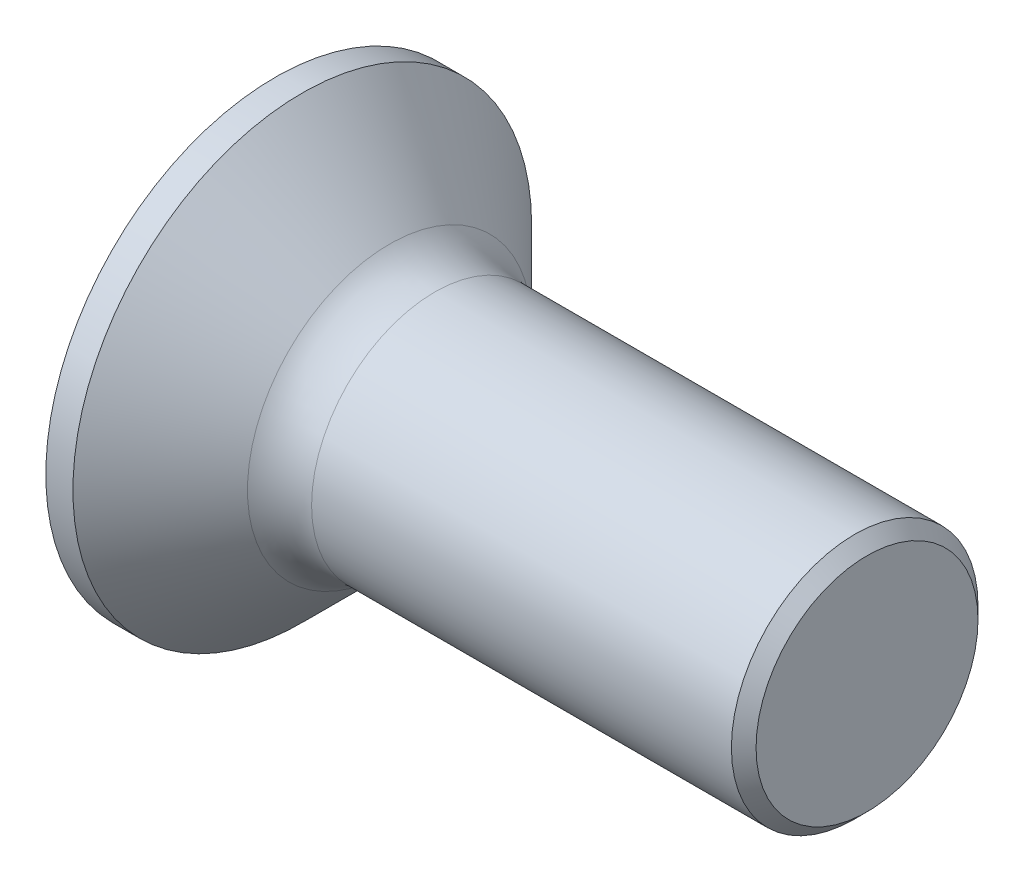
ISO-10303-21;
HEADER;
FILE_DESCRIPTION(('STEP AP214'),'2;1');
FILE_NAME('part.step','',(''),(''),'','','');
FILE_SCHEMA(('AUTOMOTIVE_DESIGN { 1 0 10303 214 1 1 1 1 }'));
ENDSEC;
DATA;
#1=APPLICATION_CONTEXT('core data for automotive mechanical design processes');
#2=APPLICATION_PROTOCOL_DEFINITION('international standard','automotive_design',2000,#1);
#3=PRODUCT_CONTEXT('',#1,'mechanical');
#4=PRODUCT('Part','Part','',(#3));
#5=PRODUCT_RELATED_PRODUCT_CATEGORY('part','',(#4));
#6=PRODUCT_DEFINITION_FORMATION('','',#4);
#7=PRODUCT_DEFINITION_CONTEXT('part definition',#1,'design');
#8=PRODUCT_DEFINITION('design','',#6,#7);
#9=PRODUCT_DEFINITION_SHAPE('','',#8);
#10=(LENGTH_UNIT() NAMED_UNIT(*) SI_UNIT(.MILLI.,.METRE.));
#11=(NAMED_UNIT(*) PLANE_ANGLE_UNIT() SI_UNIT($,.RADIAN.));
#12=(NAMED_UNIT(*) SI_UNIT($,.STERADIAN.) SOLID_ANGLE_UNIT());
#13=UNCERTAINTY_MEASURE_WITH_UNIT(LENGTH_MEASURE(1.E-05),#10,'distance_accuracy_value','');
#14=(GEOMETRIC_REPRESENTATION_CONTEXT(3) GLOBAL_UNCERTAINTY_ASSIGNED_CONTEXT((#13)) GLOBAL_UNIT_ASSIGNED_CONTEXT((#10,
#11,#12)) REPRESENTATION_CONTEXT('',''));
#15=CARTESIAN_POINT('',(0.,0.,0.));
#16=DIRECTION('',(0.,0.,1.));
#17=DIRECTION('',(1.,0.,0.));
#18=AXIS2_PLACEMENT_3D('',#15,#16,#17);
#19=CARTESIAN_POINT('',(0.275,0.,0.));
#20=DIRECTION('',(-1.,0.,0.));
#21=DIRECTION('',(0.,0.,1.));
#22=AXIS2_PLACEMENT_3D('',#19,#20,#21);
#23=CYLINDRICAL_SURFACE('',#22,4.65);
#24=CARTESIAN_POINT('',(0.55,0.,0.));
#25=DIRECTION('',(-1.,0.,0.));
#26=DIRECTION('',(0.,0.,-1.));
#27=AXIS2_PLACEMENT_3D('',#24,#25,#26);
#28=CIRCLE('',#27,4.65);
#29=CARTESIAN_POINT('',(0.55,0.,-4.65));
#30=VERTEX_POINT('',#29);
#31=EDGE_CURVE('E486',#30,#30,#28,.T.);
#32=ORIENTED_EDGE('',*,*,#31,.T.);
#33=EDGE_LOOP('',(#32));
#34=FACE_BOUND('',#33,.T.);
#35=CARTESIAN_POINT('',(0.,0.,0.));
#36=DIRECTION('',(-1.,0.,0.));
#37=DIRECTION('',(0.,0.,-1.));
#38=AXIS2_PLACEMENT_3D('',#35,#36,#37);
#39=CIRCLE('',#38,4.65);
#40=CARTESIAN_POINT('',(0.,0.,-4.65));
#41=VERTEX_POINT('',#40);
#42=EDGE_CURVE('E264',#41,#41,#39,.T.);
#43=ORIENTED_EDGE('',*,*,#42,.F.);
#44=EDGE_LOOP('',(#43));
#45=FACE_BOUND('',#44,.T.);
#46=ADVANCED_FACE('F16',(#34,#45),#23,.T.);
#47=DIRECTION('',(0.707106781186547,0.,0.707106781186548));
#48=VECTOR('',#47,1.);
#49=CARTESIAN_POINT('',(-498994.8,-1.22215714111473E-10,-499000.));
#50=LINE('',#49,#48);
#51=CARTESIAN_POINT('',(5.2,0.,0.));
#52=DIRECTION('',(-1.,0.,0.));
#53=AXIS1_PLACEMENT('',#51,#52);
#54=SURFACE_OF_REVOLUTION('',#50,#53);
#55=CARTESIAN_POINT('',(2.31923881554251,0.,0.));
#56=DIRECTION('',(-1.,0.,0.));
#57=DIRECTION('',(0.,0.,-1.));
#58=AXIS2_PLACEMENT_3D('',#55,#56,#57);
#59=CIRCLE('',#58,2.88076118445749);
#60=CARTESIAN_POINT('',(2.31923881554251,0.,-2.88076118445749));
#61=VERTEX_POINT('',#60);
#62=EDGE_CURVE('E11',#61,#61,#59,.T.);
#63=ORIENTED_EDGE('',*,*,#62,.T.);
#64=EDGE_LOOP('',(#63));
#65=FACE_BOUND('',#64,.T.);
#66=ORIENTED_EDGE('',*,*,#31,.F.);
#67=EDGE_LOOP('',(#66));
#68=FACE_BOUND('',#67,.T.);
#69=ADVANCED_FACE('F350',(#65,#68),#54,.F.);
#70=CARTESIAN_POINT('',(3.23847763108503,0.,0.));
#71=DIRECTION('',(-1.,0.,0.));
#72=DIRECTION('',(0.,0.,1.));
#73=AXIS2_PLACEMENT_3D('',#70,#71,#72);
#74=TOROIDAL_SURFACE('',#73,3.8,1.3);
#75=CARTESIAN_POINT('',(3.23847763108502,0.,0.));
#76=DIRECTION('',(-1.,0.,0.));
#77=DIRECTION('',(0.,0.,-1.));
#78=AXIS2_PLACEMENT_3D('',#75,#76,#77);
#79=CIRCLE('',#78,2.5);
#80=CARTESIAN_POINT('',(3.23847763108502,0.,-2.5));
#81=VERTEX_POINT('',#80);
#82=EDGE_CURVE('E26',#81,#81,#79,.T.);
#83=ORIENTED_EDGE('',*,*,#82,.T.);
#84=EDGE_LOOP('',(#83));
#85=FACE_BOUND('',#84,.T.);
#86=ORIENTED_EDGE('',*,*,#62,.F.);
#87=EDGE_LOOP('',(#86));
#88=FACE_BOUND('',#87,.T.);
#89=ADVANCED_FACE('F354',(#85,#88),#74,.F.);
#90=CARTESIAN_POINT('',(7.49423881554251,0.,0.));
#91=DIRECTION('',(-1.,0.,0.));
#92=DIRECTION('',(0.,0.,1.));
#93=AXIS2_PLACEMENT_3D('',#90,#91,#92);
#94=CYLINDRICAL_SURFACE('',#93,2.5);
#95=CARTESIAN_POINT('',(11.75,0.,0.));
#96=DIRECTION('',(-1.,0.,0.));
#97=DIRECTION('',(0.,0.,-1.));
#98=AXIS2_PLACEMENT_3D('',#95,#96,#97);
#99=CIRCLE('',#98,2.5);
#100=CARTESIAN_POINT('',(11.75,0.,-2.5));
#101=VERTEX_POINT('',#100);
#102=EDGE_CURVE('E512',#101,#101,#99,.T.);
#103=ORIENTED_EDGE('',*,*,#102,.T.);
#104=EDGE_LOOP('',(#103));
#105=FACE_BOUND('',#104,.T.);
#106=ORIENTED_EDGE('',*,*,#82,.F.);
#107=EDGE_LOOP('',(#106));
#108=FACE_BOUND('',#107,.T.);
#109=ADVANCED_FACE('F358',(#105,#108),#94,.T.);
#110=DIRECTION('',(0.707106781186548,0.,0.707106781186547));
#111=VECTOR('',#110,1.);
#112=CARTESIAN_POINT('',(-498985.75,-1.22215714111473E-10,-499000.));
#113=LINE('',#112,#111);
#114=CARTESIAN_POINT('',(14.25,0.,0.));
#115=DIRECTION('',(-1.,0.,0.));
#116=AXIS1_PLACEMENT('',#114,#115);
#117=SURFACE_OF_REVOLUTION('',#113,#116);
#118=CARTESIAN_POINT('',(12.,0.,0.));
#119=DIRECTION('',(-1.,0.,0.));
#120=DIRECTION('',(0.,0.,-1.));
#121=AXIS2_PLACEMENT_3D('',#118,#119,#120);
#122=CIRCLE('',#121,2.25);
#123=CARTESIAN_POINT('',(12.,0.,-2.25));
#124=VERTEX_POINT('',#123);
#125=EDGE_CURVE('E509',#124,#124,#122,.T.);
#126=ORIENTED_EDGE('',*,*,#125,.T.);
#127=EDGE_LOOP('',(#126));
#128=FACE_BOUND('',#127,.T.);
#129=ORIENTED_EDGE('',*,*,#102,.F.);
#130=EDGE_LOOP('',(#129));
#131=FACE_BOUND('',#130,.T.);
#132=ADVANCED_FACE('F362',(#128,#131),#117,.F.);
#133=CARTESIAN_POINT('',(12.,0.,-1.125));
#134=DIRECTION('',(1.,0.,0.));
#135=DIRECTION('',(0.,1.,0.));
#136=AXIS2_PLACEMENT_3D('',#133,#134,#135);
#137=PLANE('',#136);
#138=ORIENTED_EDGE('',*,*,#125,.F.);
#139=EDGE_LOOP('',(#138));
#140=FACE_BOUND('',#139,.T.);
#141=ADVANCED_FACE('F366',(#140),#137,.T.);
#142=CARTESIAN_POINT('',(-1.,-2.7,0.675));
#143=DIRECTION('',(0.,1.,0.));
#144=DIRECTION('',(0.,0.,1.));
#145=AXIS2_PLACEMENT_3D('',#142,#143,#144);
#146=PLANE('',#145);
#147=DIRECTION('',(0.,0.,-1.));
#148=VECTOR('',#147,1.);
#149=CARTESIAN_POINT('',(0.,-2.7,-0.825));
#150=LINE('',#149,#148);
#151=CARTESIAN_POINT('',(0.,-2.7,0.675));
#152=VERTEX_POINT('',#151);
#153=CARTESIAN_POINT('',(0.,-2.7,-0.675));
#154=VERTEX_POINT('',#153);
#155=EDGE_CURVE('E35',#152,#154,#150,.T.);
#156=ORIENTED_EDGE('',*,*,#155,.F.);
#157=DIRECTION('',(1.,0.,0.));
#158=VECTOR('',#157,1.);
#159=CARTESIAN_POINT('',(-1.,-2.7,0.675));
#160=LINE('',#159,#158);
#161=CARTESIAN_POINT('',(1.35,-2.7,0.675));
#162=VERTEX_POINT('',#161);
#163=EDGE_CURVE('E249',#152,#162,#160,.T.);
#164=ORIENTED_EDGE('',*,*,#163,.T.);
#165=DIRECTION('',(0.,0.,-1.));
#166=VECTOR('',#165,1.);
#167=CARTESIAN_POINT('',(1.35,-2.7,0.675));
#168=LINE('',#167,#166);
#169=CARTESIAN_POINT('',(1.35,-2.7,-0.675));
#170=VERTEX_POINT('',#169);
#171=EDGE_CURVE('E245',#162,#170,#168,.T.);
#172=ORIENTED_EDGE('',*,*,#171,.T.);
#173=DIRECTION('',(1.,0.,0.));
#174=VECTOR('',#173,1.);
#175=CARTESIAN_POINT('',(-1.,-2.7,-0.675));
#176=LINE('',#175,#174);
#177=EDGE_CURVE('E557',#154,#170,#176,.T.);
#178=ORIENTED_EDGE('',*,*,#177,.F.);
#179=EDGE_LOOP('',(#156,#164,#172,#178));
#180=FACE_BOUND('',#179,.T.);
#181=ADVANCED_FACE('F370',(#180),#146,.T.);
#182=CARTESIAN_POINT('',(4.05,0.675,0.675));
#183=DIRECTION('',(-0.6,-0.8,0.));
#184=DIRECTION('',(0.8,-0.6,0.));
#185=AXIS2_PLACEMENT_3D('',#182,#183,#184);
#186=PLANE('',#185);
#187=DIRECTION('',(-0.8,0.6,0.));
#188=VECTOR('',#187,1.);
#189=CARTESIAN_POINT('',(4.05,0.675,-0.675));
#190=LINE('',#189,#188);
#191=CARTESIAN_POINT('',(4.05,0.675,-0.675));
#192=VERTEX_POINT('',#191);
#193=CARTESIAN_POINT('',(1.35,2.7,-0.675));
#194=VERTEX_POINT('',#193);
#195=EDGE_CURVE('E228',#192,#194,#190,.T.);
#196=ORIENTED_EDGE('',*,*,#195,.F.);
#197=DIRECTION('',(0.,0.,-1.));
#198=VECTOR('',#197,1.);
#199=CARTESIAN_POINT('',(4.05,0.675,0.675));
#200=LINE('',#199,#198);
#201=CARTESIAN_POINT('',(4.05,0.675,0.675));
#202=VERTEX_POINT('',#201);
#203=EDGE_CURVE('E220',#202,#192,#200,.T.);
#204=ORIENTED_EDGE('',*,*,#203,.F.);
#205=DIRECTION('',(-0.8,0.6,0.));
#206=VECTOR('',#205,1.);
#207=CARTESIAN_POINT('',(4.05,0.675,0.675));
#208=LINE('',#207,#206);
#209=CARTESIAN_POINT('',(1.35,2.7,0.675));
#210=VERTEX_POINT('',#209);
#211=EDGE_CURVE('E225',#202,#210,#208,.T.);
#212=ORIENTED_EDGE('',*,*,#211,.T.);
#213=DIRECTION('',(0.,0.,-1.));
#214=VECTOR('',#213,1.);
#215=CARTESIAN_POINT('',(1.35,2.7,0.675));
#216=LINE('',#215,#214);
#217=EDGE_CURVE('E246',#210,#194,#216,.T.);
#218=ORIENTED_EDGE('',*,*,#217,.T.);
#219=EDGE_LOOP('',(#196,#204,#212,#218));
#220=FACE_BOUND('',#219,.T.);
#221=ADVANCED_FACE('F222',(#220),#186,.T.);
#222=CARTESIAN_POINT('',(4.05,-0.675,0.675));
#223=DIRECTION('',(-1.,0.,0.));
#224=DIRECTION('',(0.,0.,1.));
#225=AXIS2_PLACEMENT_3D('',#222,#223,#224);
#226=PLANE('',#225);
#227=DIRECTION('',(0.,0.,-1.));
#228=VECTOR('',#227,1.);
#229=CARTESIAN_POINT('',(4.05,-0.666666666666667,0.3375));
#230=LINE('',#229,#228);
#231=CARTESIAN_POINT('',(4.05,-0.666666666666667,0.675));
#232=VERTEX_POINT('',#231);
#233=CARTESIAN_POINT('',(4.05,-0.666666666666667,-0.675));
#234=VERTEX_POINT('',#233);
#235=EDGE_CURVE('E251',#232,#234,#230,.T.);
#236=ORIENTED_EDGE('',*,*,#235,.T.);
#237=DIRECTION('',(0.,1.,0.));
#238=VECTOR('',#237,1.);
#239=CARTESIAN_POINT('',(4.05,-0.675,-0.675));
#240=LINE('',#239,#238);
#241=CARTESIAN_POINT('',(4.05,-0.675,-0.675));
#242=VERTEX_POINT('',#241);
#243=EDGE_CURVE('E274',#242,#234,#240,.T.);
#244=ORIENTED_EDGE('',*,*,#243,.F.);
#245=DIRECTION('',(0.,0.,-1.));
#246=VECTOR('',#245,1.);
#247=CARTESIAN_POINT('',(4.05,-0.675,0.675));
#248=LINE('',#247,#246);
#249=CARTESIAN_POINT('',(4.05,-0.675,0.675));
#250=VERTEX_POINT('',#249);
#251=EDGE_CURVE('E331',#250,#242,#248,.T.);
#252=ORIENTED_EDGE('',*,*,#251,.F.);
#253=DIRECTION('',(0.,1.,0.));
#254=VECTOR('',#253,1.);
#255=CARTESIAN_POINT('',(4.05,-0.675,0.675));
#256=LINE('',#255,#254);
#257=EDGE_CURVE('E547',#250,#232,#256,.T.);
#258=ORIENTED_EDGE('',*,*,#257,.T.);
#259=EDGE_LOOP('',(#236,#244,#252,#258));
#260=FACE_BOUND('',#259,.T.);
#261=ADVANCED_FACE('F376',(#260),#226,.T.);
#262=CARTESIAN_POINT('',(1.35,-2.7,0.675));
#263=DIRECTION('',(-0.6,0.8,0.));
#264=DIRECTION('',(-0.8,-0.6,0.));
#265=AXIS2_PLACEMENT_3D('',#262,#263,#264);
#266=PLANE('',#265);
#267=DIRECTION('',(0.8,0.6,0.));
#268=VECTOR('',#267,1.);
#269=CARTESIAN_POINT('',(1.35,-2.7,-0.675));
#270=LINE('',#269,#268);
#271=EDGE_CURVE('E514',#170,#242,#270,.T.);
#272=ORIENTED_EDGE('',*,*,#271,.F.);
#273=ORIENTED_EDGE('',*,*,#171,.F.);
#274=DIRECTION('',(0.8,0.6,0.));
#275=VECTOR('',#274,1.);
#276=CARTESIAN_POINT('',(1.35,-2.7,0.675));
#277=LINE('',#276,#275);
#278=EDGE_CURVE('E550',#162,#250,#277,.T.);
#279=ORIENTED_EDGE('',*,*,#278,.T.);
#280=ORIENTED_EDGE('',*,*,#251,.T.);
#281=EDGE_LOOP('',(#272,#273,#279,#280));
#282=FACE_BOUND('',#281,.T.);
#283=ADVANCED_FACE('F379',(#282),#266,.T.);
#284=CARTESIAN_POINT('',(1.35,2.7,0.675));
#285=DIRECTION('',(0.,-1.,0.));
#286=DIRECTION('',(0.,0.,-1.));
#287=AXIS2_PLACEMENT_3D('',#284,#285,#286);
#288=PLANE('',#287);
#289=DIRECTION('',(0.,0.,1.));
#290=VECTOR('',#289,1.);
#291=CARTESIAN_POINT('',(0.,2.7,-0.825));
#292=LINE('',#291,#290);
#293=CARTESIAN_POINT('',(0.,2.7,-0.675));
#294=VERTEX_POINT('',#293);
#295=CARTESIAN_POINT('',(0.,2.7,0.675));
#296=VERTEX_POINT('',#295);
#297=EDGE_CURVE('E496',#294,#296,#292,.T.);
#298=ORIENTED_EDGE('',*,*,#297,.F.);
#299=DIRECTION('',(-1.,0.,0.));
#300=VECTOR('',#299,1.);
#301=CARTESIAN_POINT('',(1.35,2.7,-0.675));
#302=LINE('',#301,#300);
#303=EDGE_CURVE('E308',#194,#294,#302,.T.);
#304=ORIENTED_EDGE('',*,*,#303,.F.);
#305=ORIENTED_EDGE('',*,*,#217,.F.);
#306=DIRECTION('',(-1.,0.,0.));
#307=VECTOR('',#306,1.);
#308=CARTESIAN_POINT('',(1.35,2.7,0.675));
#309=LINE('',#308,#307);
#310=EDGE_CURVE('E244',#210,#296,#309,.T.);
#311=ORIENTED_EDGE('',*,*,#310,.T.);
#312=EDGE_LOOP('',(#298,#304,#305,#311));
#313=FACE_BOUND('',#312,.T.);
#314=ADVANCED_FACE('F383',(#313),#288,.T.);
#315=CARTESIAN_POINT('',(0.,0.,0.675));
#316=DIRECTION('',(0.,0.,-1.));
#317=DIRECTION('',(-1.,0.,0.));
#318=AXIS2_PLACEMENT_3D('',#315,#316,#317);
#319=PLANE('',#318);
#320=DIRECTION('',(-1.,0.,0.));
#321=VECTOR('',#320,1.);
#322=CARTESIAN_POINT('',(0.,0.873581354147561,0.675));
#323=LINE('',#322,#321);
#324=CARTESIAN_POINT('',(1.,0.873581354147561,0.675));
#325=VERTEX_POINT('',#324);
#326=CARTESIAN_POINT('',(0.,0.873581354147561,0.675));
#327=VERTEX_POINT('',#326);
#328=EDGE_CURVE('E332',#325,#327,#323,.T.);
#329=ORIENTED_EDGE('',*,*,#328,.T.);
#330=DIRECTION('',(0.,-1.,0.));
#331=VECTOR('',#330,1.);
#332=CARTESIAN_POINT('',(0.,0.,0.675));
#333=LINE('',#332,#331);
#334=EDGE_CURVE('E499',#296,#327,#333,.T.);
#335=ORIENTED_EDGE('',*,*,#334,.F.);
#336=ORIENTED_EDGE('',*,*,#310,.F.);
#337=ORIENTED_EDGE('',*,*,#211,.F.);
#338=DIRECTION('',(0.,1.,0.));
#339=VECTOR('',#338,1.);
#340=CARTESIAN_POINT('',(4.05,-0.675,0.675));
#341=LINE('',#340,#339);
#342=CARTESIAN_POINT('',(4.05,0.666666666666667,0.675));
#343=VERTEX_POINT('',#342);
#344=EDGE_CURVE('E230',#343,#202,#341,.T.);
#345=ORIENTED_EDGE('',*,*,#344,.F.);
#346=DIRECTION('',(-1.,0.,0.));
#347=VECTOR('',#346,1.);
#348=CARTESIAN_POINT('',(0.,0.666666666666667,0.675));
#349=LINE('',#348,#347);
#350=CARTESIAN_POINT('',(1.,0.666666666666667,0.675));
#351=VERTEX_POINT('',#350);
#352=EDGE_CURVE('E534',#343,#351,#349,.T.);
#353=ORIENTED_EDGE('',*,*,#352,.T.);
#354=DIRECTION('',(0.,1.,0.));
#355=VECTOR('',#354,1.);
#356=CARTESIAN_POINT('',(1.,0.,0.675));
#357=LINE('',#356,#355);
#358=EDGE_CURVE('E282',#351,#325,#357,.T.);
#359=ORIENTED_EDGE('',*,*,#358,.T.);
#360=EDGE_LOOP('',(#329,#335,#336,#337,#345,#353,#359));
#361=FACE_BOUND('',#360,.T.);
#362=ADVANCED_FACE('F242',(#361),#319,.T.);
#363=CARTESIAN_POINT('',(4.05,-0.675,0.675));
#364=DIRECTION('',(-1.,0.,0.));
#365=DIRECTION('',(0.,0.,1.));
#366=AXIS2_PLACEMENT_3D('',#363,#364,#365);
#367=PLANE('',#366);
#368=DIRECTION('',(0.,0.,1.));
#369=VECTOR('',#368,1.);
#370=CARTESIAN_POINT('',(4.05,0.666666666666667,0.3375));
#371=LINE('',#370,#369);
#372=CARTESIAN_POINT('',(4.05,0.666666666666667,-0.675));
#373=VERTEX_POINT('',#372);
#374=EDGE_CURVE('E236',#373,#343,#371,.T.);
#375=ORIENTED_EDGE('',*,*,#374,.T.);
#376=ORIENTED_EDGE('',*,*,#344,.T.);
#377=ORIENTED_EDGE('',*,*,#203,.T.);
#378=DIRECTION('',(0.,1.,0.));
#379=VECTOR('',#378,1.);
#380=CARTESIAN_POINT('',(4.05,-0.675,-0.675));
#381=LINE('',#380,#379);
#382=EDGE_CURVE('E313',#373,#192,#381,.T.);
#383=ORIENTED_EDGE('',*,*,#382,.F.);
#384=EDGE_LOOP('',(#375,#376,#377,#383));
#385=FACE_BOUND('',#384,.T.);
#386=ADVANCED_FACE('F234',(#385),#367,.T.);
#387=CARTESIAN_POINT('',(0.,0.,-0.675));
#388=DIRECTION('',(0.,0.,1.));
#389=DIRECTION('',(1.,0.,0.));
#390=AXIS2_PLACEMENT_3D('',#387,#388,#389);
#391=PLANE('',#390);
#392=DIRECTION('',(-1.,0.,0.));
#393=VECTOR('',#392,1.);
#394=CARTESIAN_POINT('',(0.,-0.873581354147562,-0.675));
#395=LINE('',#394,#393);
#396=CARTESIAN_POINT('',(1.,-0.873581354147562,-0.675));
#397=VERTEX_POINT('',#396);
#398=CARTESIAN_POINT('',(0.,-0.873581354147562,-0.675));
#399=VERTEX_POINT('',#398);
#400=EDGE_CURVE('E231',#397,#399,#395,.T.);
#401=ORIENTED_EDGE('',*,*,#400,.T.);
#402=DIRECTION('',(0.,1.,0.));
#403=VECTOR('',#402,1.);
#404=CARTESIAN_POINT('',(0.,0.,-0.675));
#405=LINE('',#404,#403);
#406=EDGE_CURVE('E495',#154,#399,#405,.T.);
#407=ORIENTED_EDGE('',*,*,#406,.F.);
#408=ORIENTED_EDGE('',*,*,#177,.T.);
#409=ORIENTED_EDGE('',*,*,#271,.T.);
#410=ORIENTED_EDGE('',*,*,#243,.T.);
#411=DIRECTION('',(-1.,0.,0.));
#412=VECTOR('',#411,1.);
#413=CARTESIAN_POINT('',(0.,-0.666666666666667,-0.675));
#414=LINE('',#413,#412);
#415=CARTESIAN_POINT('',(1.,-0.666666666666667,-0.675));
#416=VERTEX_POINT('',#415);
#417=EDGE_CURVE('E271',#234,#416,#414,.T.);
#418=ORIENTED_EDGE('',*,*,#417,.T.);
#419=DIRECTION('',(0.,-1.,0.));
#420=VECTOR('',#419,1.);
#421=CARTESIAN_POINT('',(1.,0.,-0.675));
#422=LINE('',#421,#420);
#423=EDGE_CURVE('E275',#416,#397,#422,.T.);
#424=ORIENTED_EDGE('',*,*,#423,.T.);
#425=EDGE_LOOP('',(#401,#407,#408,#409,#410,#418,#424));
#426=FACE_BOUND('',#425,.T.);
#427=ADVANCED_FACE('F392',(#426),#391,.T.);
#428=CARTESIAN_POINT('',(0.,0.,-2.325));
#429=DIRECTION('',(-1.,0.,0.));
#430=DIRECTION('',(0.,0.,1.));
#431=AXIS2_PLACEMENT_3D('',#428,#429,#430);
#432=PLANE('',#431);
#433=ORIENTED_EDGE('',*,*,#42,.T.);
#434=EDGE_LOOP('',(#433));
#435=FACE_BOUND('',#434,.T.);
#436=DIRECTION('',(0.,-0.642787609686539,0.766044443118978));
#437=VECTOR('',#436,1.);
#438=CARTESIAN_POINT('',(0.,0.816147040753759,-0.606552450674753));
#439=LINE('',#438,#437);
#440=CARTESIAN_POINT('',(0.,1.90918830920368,-1.90918830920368));
#441=VERTEX_POINT('',#440);
#442=CARTESIAN_POINT('',(0.,0.873581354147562,-0.675));
#443=VERTEX_POINT('',#442);
#444=EDGE_CURVE('E261',#441,#443,#439,.T.);
#445=ORIENTED_EDGE('',*,*,#444,.T.);
#446=DIRECTION('',(0.,1.,0.));
#447=VECTOR('',#446,1.);
#448=CARTESIAN_POINT('',(0.,0.,-0.675));
#449=LINE('',#448,#447);
#450=EDGE_CURVE('E265',#443,#294,#449,.T.);
#451=ORIENTED_EDGE('',*,*,#450,.T.);
#452=ORIENTED_EDGE('',*,*,#297,.T.);
#453=ORIENTED_EDGE('',*,*,#334,.T.);
#454=DIRECTION('',(0.,0.642787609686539,0.766044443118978));
#455=VECTOR('',#454,1.);
#456=CARTESIAN_POINT('',(0.,0.472307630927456,0.196780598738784));
#457=LINE('',#456,#455);
#458=CARTESIAN_POINT('',(0.,1.90918830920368,1.90918830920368));
#459=VERTEX_POINT('',#458);
#460=EDGE_CURVE('E526',#327,#459,#457,.T.);
#461=ORIENTED_EDGE('',*,*,#460,.T.);
#462=DIRECTION('',(0.,-0.766044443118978,-0.642787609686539));
#463=VECTOR('',#462,1.);
#464=CARTESIAN_POINT('',(0.,-0.648050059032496,-0.236589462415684));
#465=LINE('',#464,#463);
#466=CARTESIAN_POINT('',(0.,0.666666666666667,0.866588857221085));
#467=VERTEX_POINT('',#466);
#468=EDGE_CURVE('E530',#459,#467,#465,.T.);
#469=ORIENTED_EDGE('',*,*,#468,.T.);
#470=DIRECTION('',(0.,0.,1.));
#471=VECTOR('',#470,1.);
#472=CARTESIAN_POINT('',(0.,0.666666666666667,-1.1625));
#473=LINE('',#472,#471);
#474=CARTESIAN_POINT('',(0.,0.666666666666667,2.7));
#475=VERTEX_POINT('',#474);
#476=EDGE_CURVE('E503',#467,#475,#473,.T.);
#477=ORIENTED_EDGE('',*,*,#476,.T.);
#478=DIRECTION('',(0.,-1.,0.));
#479=VECTOR('',#478,1.);
#480=CARTESIAN_POINT('',(0.,0.333333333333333,2.7));
#481=LINE('',#480,#479);
#482=CARTESIAN_POINT('',(0.,-0.666666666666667,2.7));
#483=VERTEX_POINT('',#482);
#484=EDGE_CURVE('E500',#475,#483,#481,.T.);
#485=ORIENTED_EDGE('',*,*,#484,.T.);
#486=DIRECTION('',(0.,0.,-1.));
#487=VECTOR('',#486,1.);
#488=CARTESIAN_POINT('',(0.,-0.666666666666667,-1.1625));
#489=LINE('',#488,#487);
#490=CARTESIAN_POINT('',(0.,-0.666666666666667,0.866588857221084));
#491=VERTEX_POINT('',#490);
#492=EDGE_CURVE('E504',#483,#491,#489,.T.);
#493=ORIENTED_EDGE('',*,*,#492,.T.);
#494=DIRECTION('',(0.,-0.766044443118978,0.642787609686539));
#495=VECTOR('',#494,1.);
#496=CARTESIAN_POINT('',(0.,-0.306544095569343,0.564410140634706));
#497=LINE('',#496,#495);
#498=CARTESIAN_POINT('',(0.,-1.90918830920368,1.90918830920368));
#499=VERTEX_POINT('',#498);
#500=EDGE_CURVE('E590',#491,#499,#497,.T.);
#501=ORIENTED_EDGE('',*,*,#500,.T.);
#502=DIRECTION('',(0.,0.642787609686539,-0.766044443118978));
#503=VECTOR('',#502,1.);
#504=CARTESIAN_POINT('',(0.,0.328691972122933,-0.757813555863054));
#505=LINE('',#504,#503);
#506=CARTESIAN_POINT('',(0.,-0.873581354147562,0.675));
#507=VERTEX_POINT('',#506);
#508=EDGE_CURVE('E585',#499,#507,#505,.T.);
#509=ORIENTED_EDGE('',*,*,#508,.T.);
#510=DIRECTION('',(0.,-1.,0.));
#511=VECTOR('',#510,1.);
#512=CARTESIAN_POINT('',(0.,0.,0.675));
#513=LINE('',#512,#511);
#514=EDGE_CURVE('E494',#507,#152,#513,.T.);
#515=ORIENTED_EDGE('',*,*,#514,.T.);
#516=ORIENTED_EDGE('',*,*,#155,.T.);
#517=ORIENTED_EDGE('',*,*,#406,.T.);
#518=DIRECTION('',(0.,-0.642787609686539,-0.766044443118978));
#519=VECTOR('',#518,1.);
#520=CARTESIAN_POINT('',(0.,-1.61714664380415,-1.56114660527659));
#521=LINE('',#520,#519);
#522=CARTESIAN_POINT('',(0.,-1.90918830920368,-1.90918830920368));
#523=VERTEX_POINT('',#522);
#524=EDGE_CURVE('E506',#399,#523,#521,.T.);
#525=ORIENTED_EDGE('',*,*,#524,.T.);
#526=DIRECTION('',(0.,0.766044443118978,0.642787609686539));
#527=VECTOR('',#526,1.);
#528=CARTESIAN_POINT('',(0.,-0.496788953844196,-0.724044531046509));
#529=LINE('',#528,#527);
#530=CARTESIAN_POINT('',(0.,-0.666666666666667,-0.866588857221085));
#531=VERTEX_POINT('',#530);
#532=EDGE_CURVE('E269',#523,#531,#529,.T.);
#533=ORIENTED_EDGE('',*,*,#532,.T.);
#534=DIRECTION('',(0.,0.,-1.));
#535=VECTOR('',#534,1.);
#536=CARTESIAN_POINT('',(0.,-0.666666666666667,-1.1625));
#537=LINE('',#536,#535);
#538=CARTESIAN_POINT('',(0.,-0.666666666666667,-2.7));
#539=VERTEX_POINT('',#538);
#540=EDGE_CURVE('E266',#531,#539,#537,.T.);
#541=ORIENTED_EDGE('',*,*,#540,.T.);
#542=DIRECTION('',(0.,1.,0.));
#543=VECTOR('',#542,1.);
#544=CARTESIAN_POINT('',(0.,0.333333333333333,-2.7));
#545=LINE('',#544,#543);
#546=CARTESIAN_POINT('',(0.,0.666666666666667,-2.7));
#547=VERTEX_POINT('',#546);
#548=EDGE_CURVE('E270',#539,#547,#545,.T.);
#549=ORIENTED_EDGE('',*,*,#548,.T.);
#550=DIRECTION('',(0.,0.,1.));
#551=VECTOR('',#550,1.);
#552=CARTESIAN_POINT('',(0.,0.666666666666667,-1.1625));
#553=LINE('',#552,#551);
#554=CARTESIAN_POINT('',(0.,0.666666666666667,-0.866588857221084));
#555=VERTEX_POINT('',#554);
#556=EDGE_CURVE('E529',#547,#555,#553,.T.);
#557=ORIENTED_EDGE('',*,*,#556,.T.);
#558=DIRECTION('',(0.,0.766044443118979,-0.642787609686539));
#559=VECTOR('',#558,1.);
#560=CARTESIAN_POINT('',(0.,1.45138310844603,-1.5250441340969));
#561=LINE('',#560,#559);
#562=EDGE_CURVE('E562',#555,#441,#561,.T.);
#563=ORIENTED_EDGE('',*,*,#562,.T.);
#564=EDGE_LOOP('',(#445,#451,#452,#453,#461,#469,#477,#485,#493,#501,#509,#515,#516,#517,#525,
#533,#541,#549,#557,#563));
#565=FACE_BOUND('',#564,.T.);
#566=ADVANCED_FACE('F395',(#435,#565),#432,.T.);
#567=CARTESIAN_POINT('',(0.,-0.666666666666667,0.));
#568=DIRECTION('',(0.,1.,0.));
#569=DIRECTION('',(0.,0.,1.));
#570=AXIS2_PLACEMENT_3D('',#567,#568,#569);
#571=PLANE('',#570);
#572=DIRECTION('',(0.,0.,1.));
#573=VECTOR('',#572,1.);
#574=CARTESIAN_POINT('',(1.,-0.666666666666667,0.));
#575=LINE('',#574,#573);
#576=CARTESIAN_POINT('',(1.,-0.666666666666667,-0.866588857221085));
#577=VERTEX_POINT('',#576);
#578=EDGE_CURVE('E520',#577,#416,#575,.T.);
#579=ORIENTED_EDGE('',*,*,#578,.T.);
#580=ORIENTED_EDGE('',*,*,#417,.F.);
#581=ORIENTED_EDGE('',*,*,#235,.F.);
#582=DIRECTION('',(1.,0.,0.));
#583=VECTOR('',#582,1.);
#584=CARTESIAN_POINT('',(0.,-0.666666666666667,0.675));
#585=LINE('',#584,#583);
#586=CARTESIAN_POINT('',(1.,-0.666666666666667,0.675));
#587=VERTEX_POINT('',#586);
#588=EDGE_CURVE('E346',#587,#232,#585,.T.);
#589=ORIENTED_EDGE('',*,*,#588,.F.);
#590=DIRECTION('',(0.,0.,1.));
#591=VECTOR('',#590,1.);
#592=CARTESIAN_POINT('',(1.,-0.666666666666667,0.));
#593=LINE('',#592,#591);
#594=CARTESIAN_POINT('',(1.,-0.666666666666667,0.866588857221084));
#595=VERTEX_POINT('',#594);
#596=EDGE_CURVE('E291',#587,#595,#593,.T.);
#597=ORIENTED_EDGE('',*,*,#596,.T.);
#598=DIRECTION('',(-1.,0.,0.));
#599=VECTOR('',#598,1.);
#600=CARTESIAN_POINT('',(0.,-0.666666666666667,0.866588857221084));
#601=LINE('',#600,#599);
#602=EDGE_CURVE('E288',#595,#491,#601,.T.);
#603=ORIENTED_EDGE('',*,*,#602,.T.);
#604=ORIENTED_EDGE('',*,*,#492,.F.);
#605=DIRECTION('',(1.,0.,0.));
#606=VECTOR('',#605,1.);
#607=CARTESIAN_POINT('',(-1.,-0.666666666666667,2.7));
#608=LINE('',#607,#606);
#609=CARTESIAN_POINT('',(1.35,-0.666666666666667,2.7));
#610=VERTEX_POINT('',#609);
#611=EDGE_CURVE('E292',#483,#610,#608,.T.);
#612=ORIENTED_EDGE('',*,*,#611,.T.);
#613=DIRECTION('',(0.802852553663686,0.,-0.596177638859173));
#614=VECTOR('',#613,1.);
#615=CARTESIAN_POINT('',(1.35,-0.666666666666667,2.7));
#616=LINE('',#615,#614);
#617=CARTESIAN_POINT('',(4.077,-0.666666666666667,0.675));
#618=VERTEX_POINT('',#617);
#619=EDGE_CURVE('E307',#610,#618,#616,.T.);
#620=ORIENTED_EDGE('',*,*,#619,.T.);
#621=DIRECTION('',(0.,0.,-1.));
#622=VECTOR('',#621,1.);
#623=CARTESIAN_POINT('',(4.077,-0.666666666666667,0.675));
#624=LINE('',#623,#622);
#625=CARTESIAN_POINT('',(4.077,-0.666666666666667,-0.675));
#626=VERTEX_POINT('',#625);
#627=EDGE_CURVE('E322',#618,#626,#624,.T.);
#628=ORIENTED_EDGE('',*,*,#627,.T.);
#629=DIRECTION('',(-0.802852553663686,0.,-0.596177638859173));
#630=VECTOR('',#629,1.);
#631=CARTESIAN_POINT('',(4.077,-0.666666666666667,-0.675));
#632=LINE('',#631,#630);
#633=CARTESIAN_POINT('',(1.35,-0.666666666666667,-2.7));
#634=VERTEX_POINT('',#633);
#635=EDGE_CURVE('E319',#626,#634,#632,.T.);
#636=ORIENTED_EDGE('',*,*,#635,.T.);
#637=DIRECTION('',(-1.,0.,0.));
#638=VECTOR('',#637,1.);
#639=CARTESIAN_POINT('',(1.35,-0.666666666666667,-2.7));
#640=LINE('',#639,#638);
#641=EDGE_CURVE('E296',#634,#539,#640,.T.);
#642=ORIENTED_EDGE('',*,*,#641,.T.);
#643=ORIENTED_EDGE('',*,*,#540,.F.);
#644=DIRECTION('',(1.,0.,0.));
#645=VECTOR('',#644,1.);
#646=CARTESIAN_POINT('',(0.,-0.666666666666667,-0.866588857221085));
#647=LINE('',#646,#645);
#648=EDGE_CURVE('E293',#531,#577,#647,.T.);
#649=ORIENTED_EDGE('',*,*,#648,.T.);
#650=EDGE_LOOP('',(#579,#580,#581,#589,#597,#603,#604,#612,#620,#628,#636,#642,#643,#649));
#651=FACE_BOUND('',#650,.T.);
#652=ADVANCED_FACE('F399',(#651),#571,.T.);
#653=CARTESIAN_POINT('',(-1.,0.666666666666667,2.7));
#654=DIRECTION('',(0.,0.,-1.));
#655=DIRECTION('',(-1.,0.,0.));
#656=AXIS2_PLACEMENT_3D('',#653,#654,#655);
#657=PLANE('',#656);
#658=ORIENTED_EDGE('',*,*,#484,.F.);
#659=DIRECTION('',(1.,0.,0.));
#660=VECTOR('',#659,1.);
#661=CARTESIAN_POINT('',(-1.,0.666666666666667,2.7));
#662=LINE('',#661,#660);
#663=CARTESIAN_POINT('',(1.35,0.666666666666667,2.7));
#664=VERTEX_POINT('',#663);
#665=EDGE_CURVE('E279',#475,#664,#662,.T.);
#666=ORIENTED_EDGE('',*,*,#665,.T.);
#667=DIRECTION('',(0.,-1.,0.));
#668=VECTOR('',#667,1.);
#669=CARTESIAN_POINT('',(1.35,0.666666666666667,2.7));
#670=LINE('',#669,#668);
#671=EDGE_CURVE('E276',#664,#610,#670,.T.);
#672=ORIENTED_EDGE('',*,*,#671,.T.);
#673=ORIENTED_EDGE('',*,*,#611,.F.);
#674=EDGE_LOOP('',(#658,#666,#672,#673));
#675=FACE_BOUND('',#674,.T.);
#676=ADVANCED_FACE('F403',(#675),#657,.T.);
#677=CARTESIAN_POINT('',(4.077,0.666666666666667,-0.675));
#678=DIRECTION('',(-0.596177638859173,0.,0.802852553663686));
#679=DIRECTION('',(0.802852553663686,0.,0.596177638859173));
#680=AXIS2_PLACEMENT_3D('',#677,#678,#679);
#681=PLANE('',#680);
#682=ORIENTED_EDGE('',*,*,#635,.F.);
#683=DIRECTION('',(0.,-1.,0.));
#684=VECTOR('',#683,1.);
#685=CARTESIAN_POINT('',(4.077,0.666666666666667,-0.675));
#686=LINE('',#685,#684);
#687=CARTESIAN_POINT('',(4.077,0.666666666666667,-0.675));
#688=VERTEX_POINT('',#687);
#689=EDGE_CURVE('E257',#688,#626,#686,.T.);
#690=ORIENTED_EDGE('',*,*,#689,.F.);
#691=DIRECTION('',(-0.802852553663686,0.,-0.596177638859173));
#692=VECTOR('',#691,1.);
#693=CARTESIAN_POINT('',(4.077,0.666666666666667,-0.675));
#694=LINE('',#693,#692);
#695=CARTESIAN_POINT('',(1.35,0.666666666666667,-2.7));
#696=VERTEX_POINT('',#695);
#697=EDGE_CURVE('E280',#688,#696,#694,.T.);
#698=ORIENTED_EDGE('',*,*,#697,.T.);
#699=DIRECTION('',(0.,-1.,0.));
#700=VECTOR('',#699,1.);
#701=CARTESIAN_POINT('',(1.35,0.666666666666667,-2.7));
#702=LINE('',#701,#700);
#703=EDGE_CURVE('E106',#696,#634,#702,.T.);
#704=ORIENTED_EDGE('',*,*,#703,.T.);
#705=EDGE_LOOP('',(#682,#690,#698,#704));
#706=FACE_BOUND('',#705,.T.);
#707=ADVANCED_FACE('F407',(#706),#681,.T.);
#708=CARTESIAN_POINT('',(4.077,0.666666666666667,0.675));
#709=DIRECTION('',(-1.,0.,0.));
#710=DIRECTION('',(0.,0.,1.));
#711=AXIS2_PLACEMENT_3D('',#708,#709,#710);
#712=PLANE('',#711);
#713=ORIENTED_EDGE('',*,*,#627,.F.);
#714=DIRECTION('',(0.,-1.,0.));
#715=VECTOR('',#714,1.);
#716=CARTESIAN_POINT('',(4.077,0.666666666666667,0.675));
#717=LINE('',#716,#715);
#718=CARTESIAN_POINT('',(4.077,0.666666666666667,0.675));
#719=VERTEX_POINT('',#718);
#720=EDGE_CURVE('E112',#719,#618,#717,.T.);
#721=ORIENTED_EDGE('',*,*,#720,.F.);
#722=DIRECTION('',(0.,0.,-1.));
#723=VECTOR('',#722,1.);
#724=CARTESIAN_POINT('',(4.077,0.666666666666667,0.675));
#725=LINE('',#724,#723);
#726=EDGE_CURVE('E259',#719,#688,#725,.T.);
#727=ORIENTED_EDGE('',*,*,#726,.T.);
#728=ORIENTED_EDGE('',*,*,#689,.T.);
#729=EDGE_LOOP('',(#713,#721,#727,#728));
#730=FACE_BOUND('',#729,.T.);
#731=ADVANCED_FACE('F411',(#730),#712,.T.);
#732=CARTESIAN_POINT('',(1.35,0.666666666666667,2.7));
#733=DIRECTION('',(-0.596177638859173,0.,-0.802852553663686));
#734=DIRECTION('',(-0.802852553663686,0.,0.596177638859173));
#735=AXIS2_PLACEMENT_3D('',#732,#733,#734);
#736=PLANE('',#735);
#737=ORIENTED_EDGE('',*,*,#619,.F.);
#738=ORIENTED_EDGE('',*,*,#671,.F.);
#739=DIRECTION('',(0.802852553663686,0.,-0.596177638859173));
#740=VECTOR('',#739,1.);
#741=CARTESIAN_POINT('',(1.35,0.666666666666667,2.7));
#742=LINE('',#741,#740);
#743=EDGE_CURVE('E260',#664,#719,#742,.T.);
#744=ORIENTED_EDGE('',*,*,#743,.T.);
#745=ORIENTED_EDGE('',*,*,#720,.T.);
#746=EDGE_LOOP('',(#737,#738,#744,#745));
#747=FACE_BOUND('',#746,.T.);
#748=ADVANCED_FACE('F415',(#747),#736,.T.);
#749=CARTESIAN_POINT('',(1.35,0.666666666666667,-2.7));
#750=DIRECTION('',(0.,0.,1.));
#751=DIRECTION('',(1.,0.,0.));
#752=AXIS2_PLACEMENT_3D('',#749,#750,#751);
#753=PLANE('',#752);
#754=ORIENTED_EDGE('',*,*,#548,.F.);
#755=ORIENTED_EDGE('',*,*,#641,.F.);
#756=ORIENTED_EDGE('',*,*,#703,.F.);
#757=DIRECTION('',(-1.,0.,0.));
#758=VECTOR('',#757,1.);
#759=CARTESIAN_POINT('',(1.35,0.666666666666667,-2.7));
#760=LINE('',#759,#758);
#761=EDGE_CURVE('E299',#696,#547,#760,.T.);
#762=ORIENTED_EDGE('',*,*,#761,.T.);
#763=EDGE_LOOP('',(#754,#755,#756,#762));
#764=FACE_BOUND('',#763,.T.);
#765=ADVANCED_FACE('F418',(#764),#753,.T.);
#766=CARTESIAN_POINT('',(0.,0.666666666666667,0.));
#767=DIRECTION('',(0.,-1.,0.));
#768=DIRECTION('',(0.,0.,-1.));
#769=AXIS2_PLACEMENT_3D('',#766,#767,#768);
#770=PLANE('',#769);
#771=DIRECTION('',(0.,0.,-1.));
#772=VECTOR('',#771,1.);
#773=CARTESIAN_POINT('',(1.,0.666666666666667,0.));
#774=LINE('',#773,#772);
#775=CARTESIAN_POINT('',(1.,0.666666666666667,-0.675));
#776=VERTEX_POINT('',#775);
#777=CARTESIAN_POINT('',(1.,0.666666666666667,-0.866588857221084));
#778=VERTEX_POINT('',#777);
#779=EDGE_CURVE('E297',#776,#778,#774,.T.);
#780=ORIENTED_EDGE('',*,*,#779,.T.);
#781=DIRECTION('',(-1.,0.,0.));
#782=VECTOR('',#781,1.);
#783=CARTESIAN_POINT('',(0.,0.666666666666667,-0.866588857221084));
#784=LINE('',#783,#782);
#785=EDGE_CURVE('E286',#778,#555,#784,.T.);
#786=ORIENTED_EDGE('',*,*,#785,.T.);
#787=ORIENTED_EDGE('',*,*,#556,.F.);
#788=ORIENTED_EDGE('',*,*,#761,.F.);
#789=ORIENTED_EDGE('',*,*,#697,.F.);
#790=ORIENTED_EDGE('',*,*,#726,.F.);
#791=ORIENTED_EDGE('',*,*,#743,.F.);
#792=ORIENTED_EDGE('',*,*,#665,.F.);
#793=ORIENTED_EDGE('',*,*,#476,.F.);
#794=DIRECTION('',(1.,0.,0.));
#795=VECTOR('',#794,1.);
#796=CARTESIAN_POINT('',(0.,0.666666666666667,0.866588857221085));
#797=LINE('',#796,#795);
#798=CARTESIAN_POINT('',(1.,0.666666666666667,0.866588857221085));
#799=VERTEX_POINT('',#798);
#800=EDGE_CURVE('E283',#467,#799,#797,.T.);
#801=ORIENTED_EDGE('',*,*,#800,.T.);
#802=DIRECTION('',(0.,0.,-1.));
#803=VECTOR('',#802,1.);
#804=CARTESIAN_POINT('',(1.,0.666666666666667,0.));
#805=LINE('',#804,#803);
#806=EDGE_CURVE('E287',#799,#351,#805,.T.);
#807=ORIENTED_EDGE('',*,*,#806,.T.);
#808=ORIENTED_EDGE('',*,*,#352,.F.);
#809=ORIENTED_EDGE('',*,*,#374,.F.);
#810=DIRECTION('',(1.,0.,0.));
#811=VECTOR('',#810,1.);
#812=CARTESIAN_POINT('',(0.,0.666666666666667,-0.675));
#813=LINE('',#812,#811);
#814=EDGE_CURVE('E318',#776,#373,#813,.T.);
#815=ORIENTED_EDGE('',*,*,#814,.F.);
#816=EDGE_LOOP('',(#780,#786,#787,#788,#789,#790,#791,#792,#793,#801,#807,#808,#809,#815));
#817=FACE_BOUND('',#816,.T.);
#818=ADVANCED_FACE('F422',(#817),#770,.T.);
#819=CARTESIAN_POINT('',(0.,0.,0.675));
#820=DIRECTION('',(0.,0.,-1.));
#821=DIRECTION('',(-1.,0.,0.));
#822=AXIS2_PLACEMENT_3D('',#819,#820,#821);
#823=PLANE('',#822);
#824=DIRECTION('',(1.,0.,0.));
#825=VECTOR('',#824,1.);
#826=CARTESIAN_POINT('',(0.,-0.873581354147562,0.675));
#827=LINE('',#826,#825);
#828=CARTESIAN_POINT('',(1.,-0.873581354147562,0.675));
#829=VERTEX_POINT('',#828);
#830=EDGE_CURVE('E341',#507,#829,#827,.T.);
#831=ORIENTED_EDGE('',*,*,#830,.T.);
#832=DIRECTION('',(0.,1.,0.));
#833=VECTOR('',#832,1.);
#834=CARTESIAN_POINT('',(1.,0.,0.675));
#835=LINE('',#834,#833);
#836=EDGE_CURVE('E131',#829,#587,#835,.T.);
#837=ORIENTED_EDGE('',*,*,#836,.T.);
#838=ORIENTED_EDGE('',*,*,#588,.T.);
#839=ORIENTED_EDGE('',*,*,#257,.F.);
#840=ORIENTED_EDGE('',*,*,#278,.F.);
#841=ORIENTED_EDGE('',*,*,#163,.F.);
#842=ORIENTED_EDGE('',*,*,#514,.F.);
#843=EDGE_LOOP('',(#831,#837,#838,#839,#840,#841,#842));
#844=FACE_BOUND('',#843,.T.);
#845=ADVANCED_FACE('F425',(#844),#823,.T.);
#846=CARTESIAN_POINT('',(0.,0.,-0.675));
#847=DIRECTION('',(0.,0.,1.));
#848=DIRECTION('',(1.,0.,0.));
#849=AXIS2_PLACEMENT_3D('',#846,#847,#848);
#850=PLANE('',#849);
#851=DIRECTION('',(1.,0.,0.));
#852=VECTOR('',#851,1.);
#853=CARTESIAN_POINT('',(0.,0.873581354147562,-0.675));
#854=LINE('',#853,#852);
#855=CARTESIAN_POINT('',(1.,0.873581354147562,-0.675));
#856=VERTEX_POINT('',#855);
#857=EDGE_CURVE('E317',#443,#856,#854,.T.);
#858=ORIENTED_EDGE('',*,*,#857,.T.);
#859=DIRECTION('',(0.,-1.,0.));
#860=VECTOR('',#859,1.);
#861=CARTESIAN_POINT('',(1.,0.,-0.675));
#862=LINE('',#861,#860);
#863=EDGE_CURVE('E314',#856,#776,#862,.T.);
#864=ORIENTED_EDGE('',*,*,#863,.T.);
#865=ORIENTED_EDGE('',*,*,#814,.T.);
#866=ORIENTED_EDGE('',*,*,#382,.T.);
#867=ORIENTED_EDGE('',*,*,#195,.T.);
#868=ORIENTED_EDGE('',*,*,#303,.T.);
#869=ORIENTED_EDGE('',*,*,#450,.F.);
#870=EDGE_LOOP('',(#858,#864,#865,#866,#867,#868,#869));
#871=FACE_BOUND('',#870,.T.);
#872=ADVANCED_FACE('F429',(#871),#850,.T.);
#873=CARTESIAN_POINT('',(0.,0.,0.307189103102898));
#874=DIRECTION('',(0.,0.642787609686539,-0.766044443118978));
#875=DIRECTION('',(0.,0.766044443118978,0.642787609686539));
#876=AXIS2_PLACEMENT_3D('',#873,#874,#875);
#877=PLANE('',#876);
#878=ORIENTED_EDGE('',*,*,#800,.F.);
#879=ORIENTED_EDGE('',*,*,#468,.F.);
#880=DIRECTION('',(1.,0.,0.));
#881=VECTOR('',#880,1.);
#882=CARTESIAN_POINT('',(0.,1.90918830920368,1.90918830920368));
#883=LINE('',#882,#881);
#884=CARTESIAN_POINT('',(1.,1.90918830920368,1.90918830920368));
#885=VERTEX_POINT('',#884);
#886=EDGE_CURVE('E311',#459,#885,#883,.T.);
#887=ORIENTED_EDGE('',*,*,#886,.T.);
#888=DIRECTION('',(0.,0.766044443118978,0.642787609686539));
#889=VECTOR('',#888,1.);
#890=CARTESIAN_POINT('',(1.,0.,0.307189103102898));
#891=LINE('',#890,#889);
#892=EDGE_CURVE('E301',#799,#885,#891,.T.);
#893=ORIENTED_EDGE('',*,*,#892,.F.);
#894=EDGE_LOOP('',(#878,#879,#887,#893));
#895=FACE_BOUND('',#894,.T.);
#896=ADVANCED_FACE('F433',(#895),#877,.T.);
#897=CARTESIAN_POINT('',(0.,-1.90918830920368,1.90918830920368));
#898=DIRECTION('',(0.,-0.642787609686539,-0.766044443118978));
#899=DIRECTION('',(0.,0.766044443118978,-0.642787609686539));
#900=AXIS2_PLACEMENT_3D('',#897,#898,#899);
#901=PLANE('',#900);
#902=ORIENTED_EDGE('',*,*,#602,.F.);
#903=DIRECTION('',(0.,0.766044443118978,-0.642787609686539));
#904=VECTOR('',#903,1.);
#905=CARTESIAN_POINT('',(1.,-1.90918830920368,1.90918830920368));
#906=LINE('',#905,#904);
#907=CARTESIAN_POINT('',(1.,-1.90918830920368,1.90918830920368));
#908=VERTEX_POINT('',#907);
#909=EDGE_CURVE('E338',#908,#595,#906,.T.);
#910=ORIENTED_EDGE('',*,*,#909,.F.);
#911=DIRECTION('',(1.,0.,0.));
#912=VECTOR('',#911,1.);
#913=CARTESIAN_POINT('',(0.,-1.90918830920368,1.90918830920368));
#914=LINE('',#913,#912);
#915=EDGE_CURVE('E303',#499,#908,#914,.T.);
#916=ORIENTED_EDGE('',*,*,#915,.F.);
#917=ORIENTED_EDGE('',*,*,#500,.F.);
#918=EDGE_LOOP('',(#902,#910,#916,#917));
#919=FACE_BOUND('',#918,.T.);
#920=ADVANCED_FACE('F437',(#919),#901,.T.);
#921=CARTESIAN_POINT('',(0.,0.,-0.307189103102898));
#922=DIRECTION('',(0.,-0.642787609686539,0.766044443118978));
#923=DIRECTION('',(0.,-0.766044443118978,-0.642787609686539));
#924=AXIS2_PLACEMENT_3D('',#921,#922,#923);
#925=PLANE('',#924);
#926=ORIENTED_EDGE('',*,*,#648,.F.);
#927=ORIENTED_EDGE('',*,*,#532,.F.);
#928=DIRECTION('',(1.,0.,0.));
#929=VECTOR('',#928,1.);
#930=CARTESIAN_POINT('',(0.,-1.90918830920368,-1.90918830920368));
#931=LINE('',#930,#929);
#932=CARTESIAN_POINT('',(1.,-1.90918830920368,-1.90918830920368));
#933=VERTEX_POINT('',#932);
#934=EDGE_CURVE('E327',#523,#933,#931,.T.);
#935=ORIENTED_EDGE('',*,*,#934,.T.);
#936=DIRECTION('',(0.,-0.766044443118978,-0.642787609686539));
#937=VECTOR('',#936,1.);
#938=CARTESIAN_POINT('',(1.,0.,-0.307189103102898));
#939=LINE('',#938,#937);
#940=EDGE_CURVE('E255',#577,#933,#939,.T.);
#941=ORIENTED_EDGE('',*,*,#940,.F.);
#942=EDGE_LOOP('',(#926,#927,#935,#941));
#943=FACE_BOUND('',#942,.T.);
#944=ADVANCED_FACE('F441',(#943),#925,.T.);
#945=CARTESIAN_POINT('',(0.,1.90918830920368,-1.90918830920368));
#946=DIRECTION('',(0.,0.642787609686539,0.766044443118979));
#947=DIRECTION('',(0.,-0.766044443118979,0.642787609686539));
#948=AXIS2_PLACEMENT_3D('',#945,#946,#947);
#949=PLANE('',#948);
#950=ORIENTED_EDGE('',*,*,#785,.F.);
#951=DIRECTION('',(0.,-0.766044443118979,0.642787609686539));
#952=VECTOR('',#951,1.);
#953=CARTESIAN_POINT('',(1.,1.90918830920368,-1.90918830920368));
#954=LINE('',#953,#952);
#955=CARTESIAN_POINT('',(1.,1.90918830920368,-1.90918830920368));
#956=VERTEX_POINT('',#955);
#957=EDGE_CURVE('E120',#956,#778,#954,.T.);
#958=ORIENTED_EDGE('',*,*,#957,.F.);
#959=DIRECTION('',(1.,0.,0.));
#960=VECTOR('',#959,1.);
#961=CARTESIAN_POINT('',(0.,1.90918830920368,-1.90918830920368));
#962=LINE('',#961,#960);
#963=EDGE_CURVE('E329',#441,#956,#962,.T.);
#964=ORIENTED_EDGE('',*,*,#963,.F.);
#965=ORIENTED_EDGE('',*,*,#562,.F.);
#966=EDGE_LOOP('',(#950,#958,#964,#965));
#967=FACE_BOUND('',#966,.T.);
#968=ADVANCED_FACE('F445',(#967),#949,.T.);
#969=CARTESIAN_POINT('',(1.,0.,0.));
#970=DIRECTION('',(-1.,0.,0.));
#971=DIRECTION('',(0.,0.,1.));
#972=AXIS2_PLACEMENT_3D('',#969,#970,#971);
#973=PLANE('',#972);
#974=ORIENTED_EDGE('',*,*,#863,.F.);
#975=DIRECTION('',(0.,0.642787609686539,-0.766044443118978));
#976=VECTOR('',#975,1.);
#977=CARTESIAN_POINT('',(1.,0.307189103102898,0.));
#978=LINE('',#977,#976);
#979=EDGE_CURVE('E141',#856,#956,#978,.T.);
#980=ORIENTED_EDGE('',*,*,#979,.T.);
#981=ORIENTED_EDGE('',*,*,#957,.T.);
#982=ORIENTED_EDGE('',*,*,#779,.F.);
#983=EDGE_LOOP('',(#974,#980,#981,#982));
#984=FACE_BOUND('',#983,.T.);
#985=ADVANCED_FACE('F449',(#984),#973,.T.);
#986=CARTESIAN_POINT('',(1.,0.,0.));
#987=DIRECTION('',(-1.,0.,0.));
#988=DIRECTION('',(0.,0.,1.));
#989=AXIS2_PLACEMENT_3D('',#986,#987,#988);
#990=PLANE('',#989);
#991=ORIENTED_EDGE('',*,*,#358,.F.);
#992=ORIENTED_EDGE('',*,*,#806,.F.);
#993=ORIENTED_EDGE('',*,*,#892,.T.);
#994=DIRECTION('',(0.,-0.642787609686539,-0.766044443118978));
#995=VECTOR('',#994,1.);
#996=CARTESIAN_POINT('',(1.,1.90918830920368,1.90918830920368));
#997=LINE('',#996,#995);
#998=EDGE_CURVE('E337',#885,#325,#997,.T.);
#999=ORIENTED_EDGE('',*,*,#998,.T.);
#1000=EDGE_LOOP('',(#991,#992,#993,#999));
#1001=FACE_BOUND('',#1000,.T.);
#1002=ADVANCED_FACE('F453',(#1001),#990,.T.);
#1003=CARTESIAN_POINT('',(1.,0.,0.));
#1004=DIRECTION('',(-1.,0.,0.));
#1005=DIRECTION('',(0.,0.,1.));
#1006=AXIS2_PLACEMENT_3D('',#1003,#1004,#1005);
#1007=PLANE('',#1006);
#1008=ORIENTED_EDGE('',*,*,#836,.F.);
#1009=DIRECTION('',(0.,-0.642787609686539,0.766044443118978));
#1010=VECTOR('',#1009,1.);
#1011=CARTESIAN_POINT('',(1.,-0.307189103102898,0.));
#1012=LINE('',#1011,#1010);
#1013=EDGE_CURVE('E335',#829,#908,#1012,.T.);
#1014=ORIENTED_EDGE('',*,*,#1013,.T.);
#1015=ORIENTED_EDGE('',*,*,#909,.T.);
#1016=ORIENTED_EDGE('',*,*,#596,.F.);
#1017=EDGE_LOOP('',(#1008,#1014,#1015,#1016));
#1018=FACE_BOUND('',#1017,.T.);
#1019=ADVANCED_FACE('F456',(#1018),#1007,.T.);
#1020=CARTESIAN_POINT('',(1.,0.,0.));
#1021=DIRECTION('',(-1.,0.,0.));
#1022=DIRECTION('',(0.,0.,1.));
#1023=AXIS2_PLACEMENT_3D('',#1020,#1021,#1022);
#1024=PLANE('',#1023);
#1025=ORIENTED_EDGE('',*,*,#423,.F.);
#1026=ORIENTED_EDGE('',*,*,#578,.F.);
#1027=ORIENTED_EDGE('',*,*,#940,.T.);
#1028=DIRECTION('',(0.,0.642787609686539,0.766044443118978));
#1029=VECTOR('',#1028,1.);
#1030=CARTESIAN_POINT('',(1.,-1.90918830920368,-1.90918830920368));
#1031=LINE('',#1030,#1029);
#1032=EDGE_CURVE('E302',#933,#397,#1031,.T.);
#1033=ORIENTED_EDGE('',*,*,#1032,.T.);
#1034=EDGE_LOOP('',(#1025,#1026,#1027,#1033));
#1035=FACE_BOUND('',#1034,.T.);
#1036=ADVANCED_FACE('F460',(#1035),#1024,.T.);
#1037=CARTESIAN_POINT('',(0.,1.90918830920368,1.90918830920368));
#1038=DIRECTION('',(0.,-0.766044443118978,0.642787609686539));
#1039=DIRECTION('',(0.,-0.642787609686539,-0.766044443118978));
#1040=AXIS2_PLACEMENT_3D('',#1037,#1038,#1039);
#1041=PLANE('',#1040);
#1042=ORIENTED_EDGE('',*,*,#328,.F.);
#1043=ORIENTED_EDGE('',*,*,#998,.F.);
#1044=ORIENTED_EDGE('',*,*,#886,.F.);
#1045=ORIENTED_EDGE('',*,*,#460,.F.);
#1046=EDGE_LOOP('',(#1042,#1043,#1044,#1045));
#1047=FACE_BOUND('',#1046,.T.);
#1048=ADVANCED_FACE('F463',(#1047),#1041,.T.);
#1049=CARTESIAN_POINT('',(0.,-0.307189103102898,0.));
#1050=DIRECTION('',(0.,0.766044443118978,0.642787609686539));
#1051=DIRECTION('',(0.,-0.642787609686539,0.766044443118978));
#1052=AXIS2_PLACEMENT_3D('',#1049,#1050,#1051);
#1053=PLANE('',#1052);
#1054=ORIENTED_EDGE('',*,*,#830,.F.);
#1055=ORIENTED_EDGE('',*,*,#508,.F.);
#1056=ORIENTED_EDGE('',*,*,#915,.T.);
#1057=ORIENTED_EDGE('',*,*,#1013,.F.);
#1058=EDGE_LOOP('',(#1054,#1055,#1056,#1057));
#1059=FACE_BOUND('',#1058,.T.);
#1060=ADVANCED_FACE('F467',(#1059),#1053,.T.);
#1061=CARTESIAN_POINT('',(0.,-1.90918830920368,-1.90918830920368));
#1062=DIRECTION('',(0.,0.766044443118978,-0.642787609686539));
#1063=DIRECTION('',(0.,0.642787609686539,0.766044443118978));
#1064=AXIS2_PLACEMENT_3D('',#1061,#1062,#1063);
#1065=PLANE('',#1064);
#1066=ORIENTED_EDGE('',*,*,#400,.F.);
#1067=ORIENTED_EDGE('',*,*,#1032,.F.);
#1068=ORIENTED_EDGE('',*,*,#934,.F.);
#1069=ORIENTED_EDGE('',*,*,#524,.F.);
#1070=EDGE_LOOP('',(#1066,#1067,#1068,#1069));
#1071=FACE_BOUND('',#1070,.T.);
#1072=ADVANCED_FACE('F470',(#1071),#1065,.T.);
#1073=CARTESIAN_POINT('',(0.,0.307189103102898,0.));
#1074=DIRECTION('',(0.,-0.766044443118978,-0.642787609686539));
#1075=DIRECTION('',(0.,0.642787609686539,-0.766044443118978));
#1076=AXIS2_PLACEMENT_3D('',#1073,#1074,#1075);
#1077=PLANE('',#1076);
#1078=ORIENTED_EDGE('',*,*,#857,.F.);
#1079=ORIENTED_EDGE('',*,*,#444,.F.);
#1080=ORIENTED_EDGE('',*,*,#963,.T.);
#1081=ORIENTED_EDGE('',*,*,#979,.F.);
#1082=EDGE_LOOP('',(#1078,#1079,#1080,#1081));
#1083=FACE_BOUND('',#1082,.T.);
#1084=ADVANCED_FACE('F18',(#1083),#1077,.T.);
#1085=CLOSED_SHELL('',(#46,#69,#89,#109,#132,#141,#181,#221,#261,#283,#314,#362,#386,#427,#566,
#652,#676,#707,#731,#748,#765,#818,#845,#872,#896,#920,#944,#968,#985,#1002,#1019,#1036,#1048,
#1060,#1072,#1084));
#1086=MANIFOLD_SOLID_BREP('B1',#1085);
#1087=ADVANCED_BREP_SHAPE_REPRESENTATION('',(#18,#1086),#14);
#1088=SHAPE_DEFINITION_REPRESENTATION(#9,#1087);
ENDSEC;
END-ISO-10303-21;
